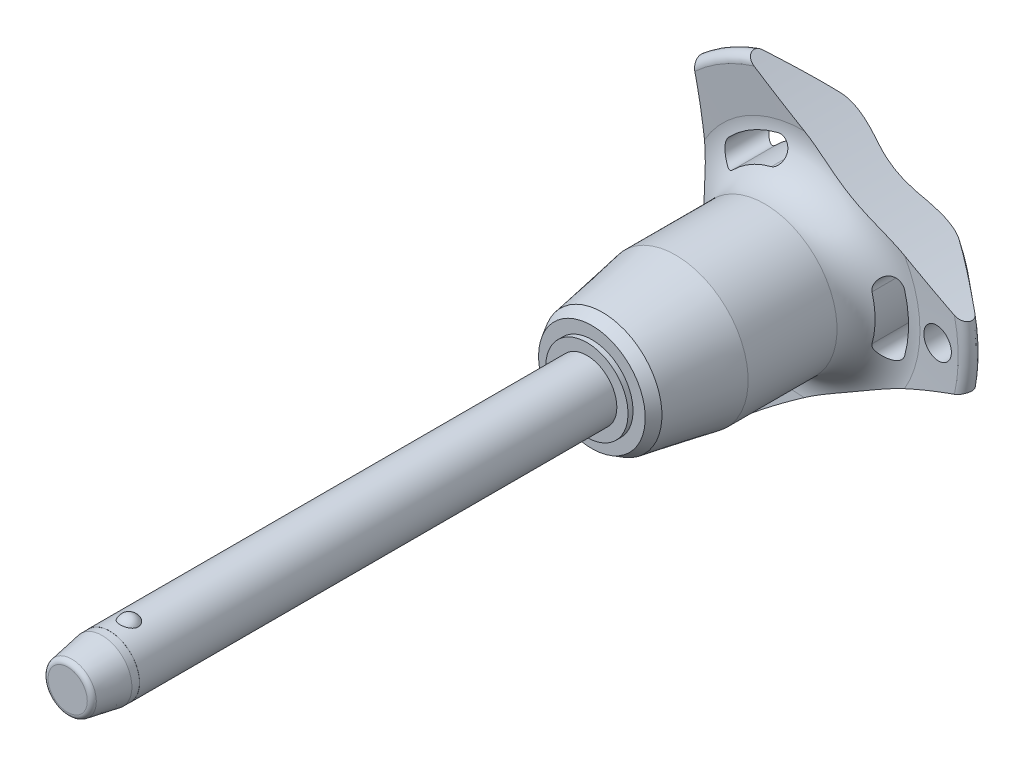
from build123d import *

# Parameters (mm, degrees)
SKETCH1_R           = 3
BOSS_EXTRUDE1_DEPTH = 45
SKETCH2_R           = 2.5
BOSS_EXTRUDE2_DEPTH = 26.7
BOSS_EXTRUDE3_START = 7
SKETCH1_2_R         = 3
BOSS_EXTRUDE3_DEPTH = 7
CHAMFER1_SIZE       = 3.5
CHAMFER1_SIZE2      = 0.617144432
FILLET1_R           = 0.5
SKETCH6_R           = 79.96
CUT_EXTRUDE1_DEPTH  = 76.446116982
CIRPATTERN1_COUNT   = 3
SKETCH7_R           = 1.5
CUT_EXTRUDE2_DEPTH  = 76.244100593
SKETCH8_R           = 3
SKETCH8_R_2         = 2.99
CUT_EXTRUDE3_DEPTH  = 4.2


with BuildPart() as part:
    # Sketch1 → Boss-Extrude1 (new body)
    with BuildSketch(Plane.XY):
        Circle(SKETCH1_R)
    extrude(amount=-BOSS_EXTRUDE1_DEPTH)

    # Sketch2 → Boss-Extrude2 (add)
    with BuildSketch(Plane(origin=(0, 0, -45), x_dir=(-1, 0, 0), z_dir=(0, 0, -1))):
        Circle(SKETCH2_R)
    extrude(amount=BOSS_EXTRUDE2_DEPTH)

    # Sketch3 → Revolve1 (revolve)
    with BuildSketch(Plane(origin=(0, 0, 0), x_dir=(0, 0, -1), z_dir=(1, 0, 0))):
        with BuildLine():
            Line((-0.866025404, 3.5), (-0.866025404, 1.5))
            ThreePointArc((-0.866025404, 1.5), (0.133974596, 2.5), (-0.866025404, 3.5))
        make_face()
        with BuildLine():
            Line((-0.866025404, -1.5), (-0.866025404, -3.5))
            ThreePointArc((-0.866025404, -3.5), (0.133974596, -2.5), (-0.866025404, -1.5))
        make_face()
    revolve(axis=Axis((0, -1.5, 0.866025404), (0, 1, 0)))

    # Sketch1_2 → Boss-Extrude3 (add)
    with BuildSketch(Plane.XY.offset(BOSS_EXTRUDE3_START)):
        Circle(SKETCH1_2_R)
    extrude(amount=-BOSS_EXTRUDE3_DEPTH)

    # Chamfer1
    chamfer1_edges = [part.edges().sort_by_distance(p)[0] for p in [
        (-3, 0, 7),
    ]]
    chamfer1_side = [part.faces().sort_by_distance(p)[0] for p in [
        (-3, 0, -19),
    ]]
    chamfer(chamfer1_edges, length=CHAMFER1_SIZE, length2=CHAMFER1_SIZE2, reference=chamfer1_side[0])

    # Fillet1
    fillet1_edges = [part.edges().sort_by_distance(p)[0] for p in [
        (-2.382855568, 0, 7),
        (2.5, 0, -71.7),
    ]]
    fillet(fillet1_edges, radius=FILLET1_R)

    # Sketch4 → Revolve2 (revolve)
    with BuildSketch(Plane(origin=(0, 0, 0), x_dir=(0, 0, -1), z_dir=(1, 0, 0)), mode=Mode.PRIVATE) as revolve2_sk:
        Polygon((45, 0), (45, 4.118359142), (45.5, 4.118359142), (45.5, 5.343400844), (46.560917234, 5.955921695), (53.9, 7.25), (62.8, 7.25), (62.8, 0), align=None)
    revolve(revolve2_sk.sketch.rotate(Axis((0, 0, -62.8), (0, 0, 1)), 90), axis=Axis((0, 0, -62.8), (0, 0, 1)))

    # Sketch5 → Revolve3 (revolve)
    with BuildSketch(Plane(origin=(0, 0, 0), x_dir=(0, 0, -1), z_dir=(1, 0, 0)), mode=Mode.PRIVATE) as revolve3_sk:
        with BuildLine():
            Line((66.78715932, 11.570250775), (66.452568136, 15.735949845))
            ThreePointArc((66.452568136, 15.735949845), (66.946485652, 16.540188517), (67.862835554, 16.314230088))
            Line((67.862835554, 16.314230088), (71.326414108, 12.186497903))
            ThreePointArc((71.326414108, 12.186497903), (71.7, 11.109282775), (71.261488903, 10.056825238))
            ThreePointArc((71.261488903, 10.056825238), (68.289873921, 5.413681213), (67.25, 0))
            Line((67.25, 0), (62.8, 0))
            Line((62.8, 0), (62.8, 7.25))
            ThreePointArc((62.8, 7.25), (65.739473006, 8.537160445), (66.78715932, 11.570250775))
        make_face()
    revolve(revolve3_sk.sketch.rotate(Axis((0, 0, -67.25), (0, 0, 1)), 90), axis=Axis((0, 0, -67.25), (0, 0, 1)))

    # Sketch6 → Cut-Extrude1 (cut, through all)
    with BuildSketch(Plane.XY):
        with Locations((-89.76, 0)):
            Circle(SKETCH6_R)
        with BuildLine():
            ThreePointArc((10.099921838, -2.834717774), (10.490188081, 0), (10.099921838, 2.834717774))
            ThreePointArc((10.099921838, 2.834717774), (8.768180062, 3.582738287), (8.020159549, 2.250996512))
            ThreePointArc((8.020159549, 2.250996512), (8.330062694, 0), (8.020159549, -2.250996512))
            ThreePointArc((8.020159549, -2.250996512), (8.768180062, -3.582738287), (10.099921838, -2.834717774))
        make_face()
    cut_extrude1 = extrude(amount=-CUT_EXTRUDE1_DEPTH, mode=Mode.SUBTRACT)

    # CirPattern1: Cut-Extrude1 ×3 about axis
    cirpattern1_axis = Axis((0, 0, 0), (0, 0, 1))
    for i in range(1, CIRPATTERN1_COUNT):
        add(cut_extrude1.rotate(cirpattern1_axis, i * 360 / CIRPATTERN1_COUNT), mode=Mode.SUBTRACT)

    # Sketch7 → Cut-Extrude2 (cut, through all)
    with BuildSketch(Plane.XY):
        with Locations(Location((13.490188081, 0, 0), (0, 0, 225.221865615))):
            Circle(SKETCH7_R)
    extrude(amount=-CUT_EXTRUDE2_DEPTH, mode=Mode.SUBTRACT)

    # Sketch8 → Cut-Extrude3 (cut)
    with BuildSketch(Plane.XY.offset(7)):
        Circle(SKETCH8_R)
        Circle(SKETCH8_R_2, mode=Mode.SUBTRACT)
    extrude(amount=-CUT_EXTRUDE3_DEPTH, mode=Mode.SUBTRACT)


solid = part.part
